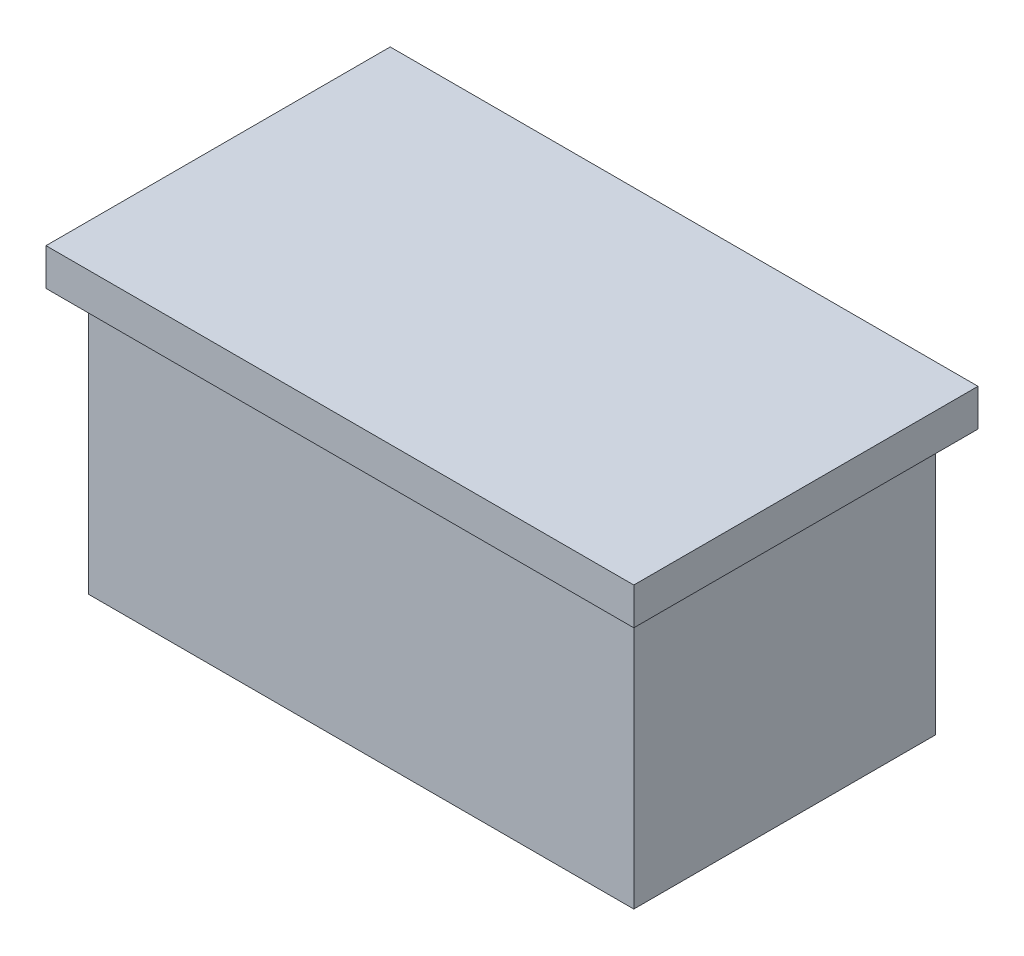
from build123d import *

# Parameters (mm, degrees)
SKETCH1_W      = 103
SKETCH1_H      = 57
EXTRUDE1_DEPTH = 50
SKETCH2_W      = 111
SKETCH2_H      = 65
EXTRUDE2_DEPTH = 7


with BuildPart() as part:
    # Sketch1 → Extrude1 (new body)
    with BuildSketch(Plane(origin=(0, 0, 0), x_dir=(1, 0, 0), z_dir=(0, 1, 0))):
        Rectangle(SKETCH1_W, SKETCH1_H)
    extrude(amount=EXTRUDE1_DEPTH)

    # Sketch2 → Extrude2 (add)
    with BuildSketch(Plane(origin=(0, 50, 0), x_dir=(1, 0, 0), z_dir=(0, 1, 0))):
        Rectangle(SKETCH2_W, SKETCH2_H)
    extrude(amount=EXTRUDE2_DEPTH)


solid = part.part
